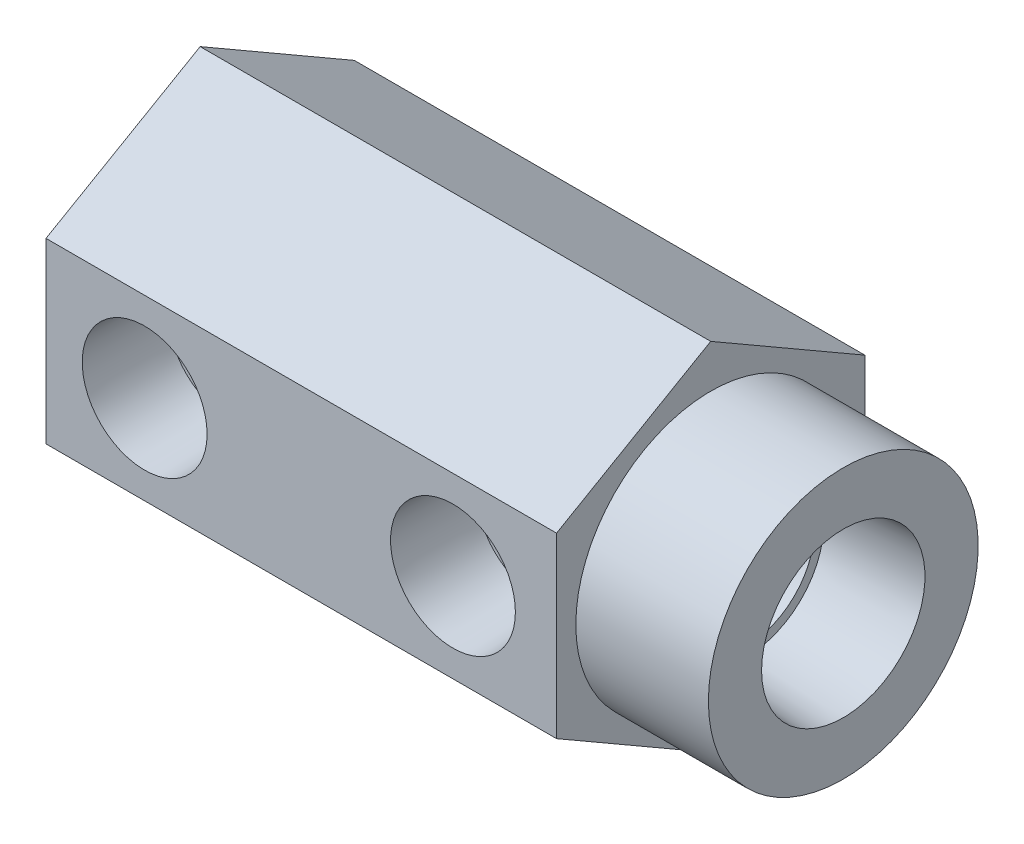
from build123d import *

# Parameters (mm, degrees)
BOSS_EXTRUDE1_DEPTH                 = 42.0624
SKETCH2_R                           = 11.1125
BOSS_EXTRUDE2_DEPTH                 = 52.9844
F_1_4_0_25_DIAMETER_HOLE1_D         = 6.35
F_1_4_0_25_DIAMETER_HOLE1_DEPTH     = 31.75
F_1_4_0_25_DIAMETER_HOLE1_TIP       = 1.907732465
F_7_32_0_21875_DIAMETER_HOLE1_D     = 5.55625
F_7_32_0_21875_DIAMETER_HOLE1_DEPTH = 44.45
F_7_32_0_21875_DIAMETER_HOLE1_TIP   = 1.669265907
F_1_8_NPT_TAPPED_HOLE1_AT_2_COUNT   = 2
F_1_8_NPT_TAPPED_HOLE1_AT_2_PITCH   = 25.4


with BuildPart() as part:
    # Sketch1 → Boss-Extrude1 (new body)
    with BuildSketch(Plane(origin=(0, 0, 0), x_dir=(0, 0, -1), z_dir=(1, 0, 0))):
        Polygon((0, -14.664696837), (12.7, -7.332348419), (12.7, 7.332348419), (0, 14.664696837), (-12.7, 7.332348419), (-12.7, -7.332348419), align=None)
    extrude(amount=BOSS_EXTRUDE1_DEPTH)

    # Sketch2 → Boss-Extrude2 (add)
    with BuildSketch(Plane(origin=(0, 0, 0), x_dir=(0, 0, -1), z_dir=(1, 0, 0))):
        with Locations(Location((0, 0, 0), (0, 0, 180))):
            Circle(SKETCH2_R)
    extrude(amount=BOSS_EXTRUDE2_DEPTH)

    # 1_4 _0.25_ Diameter Hole1
    with Locations(Plane(origin=(52.9844, 0, 0), x_dir=(0, 0, -1), z_dir=(1, 0, 0))):
        with Locations((0, 0)):
            Hole(F_1_4_0_25_DIAMETER_HOLE1_D / 2, depth=F_1_4_0_25_DIAMETER_HOLE1_DEPTH)
            with Locations((0, 0, -(F_1_4_0_25_DIAMETER_HOLE1_DEPTH + F_1_4_0_25_DIAMETER_HOLE1_TIP / 2))):  # 118° drill point
                Cone(0, F_1_4_0_25_DIAMETER_HOLE1_D / 2, F_1_4_0_25_DIAMETER_HOLE1_TIP, mode=Mode.SUBTRACT)

    # 7_32 _0.21875_ Diameter Hole1
    with Locations(Plane(origin=(52.9844, 0, 0), x_dir=(0, 0, -1), z_dir=(1, 0, 0))):
        with Locations((0, 0)):
            Hole(F_7_32_0_21875_DIAMETER_HOLE1_D / 2, depth=F_7_32_0_21875_DIAMETER_HOLE1_DEPTH)
            with Locations((0, 0, -(F_7_32_0_21875_DIAMETER_HOLE1_DEPTH + F_7_32_0_21875_DIAMETER_HOLE1_TIP / 2))):  # 118° drill point
                Cone(0, F_7_32_0_21875_DIAMETER_HOLE1_D / 2, F_7_32_0_21875_DIAMETER_HOLE1_TIP, mode=Mode.SUBTRACT)

    # Sketch7 → 1_8 NPT Tapped Hole1 (revolve, cut)
    with BuildSketch(Plane(origin=(8.128, 0, 12.7), x_dir=(0, -1, 0), z_dir=(1, 0, 0))):
        Polygon((0, 0), (0, 21.583468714), (4.2164, 19.05), (4.2164, 6.92404), (4.93618497, 6.92404), (5.1435, 0), align=None)
    f_1_8_npt_tapped_hole1 = revolve(axis=Axis((8.128, 0, 19.05), (0, 0, -1)), mode=Mode.SUBTRACT)

    # 1_8 NPT Tapped Hole1 at 2: 1_8 NPT Tapped Hole1 ×2
    with Locations(*[(i * F_1_8_NPT_TAPPED_HOLE1_AT_2_PITCH, 0, 0) for i in range(1, F_1_8_NPT_TAPPED_HOLE1_AT_2_COUNT)]):
        add(f_1_8_npt_tapped_hole1, mode=Mode.SUBTRACT)

    # Sketch9 → 1_8 NPT Tapped Hole2 (revolve, cut)
    with BuildSketch(Plane(origin=(8.128, 0, -12.7), x_dir=(0, 1, 0), z_dir=(1, 0, 0))):
        Polygon((0, 0), (0, 18.408468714), (4.2164, 15.875), (4.2164, 6.92404), (4.93618497, 6.92404), (5.1435, 0), align=None)
    revolve(axis=Axis((8.128, 0, -19.05), (0, 0, 1)), mode=Mode.SUBTRACT)

    # Sketch11 → Cut-Revolve1 (revolve, cut)
    with BuildSketch(Plane(origin=(0, 0, 0), x_dir=(1, 0, 0), z_dir=(0, 1, 0)), mode=Mode.PRIVATE) as cut_revolve1_sk:
        Polygon((52.9844, 0), (52.9844, 6.731), (45.0596, 6.315678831), (45.0596, 5.5499), (27.5844, 5.5499), (27.5844, 0), align=None)
    revolve(cut_revolve1_sk.sketch.rotate(Axis((0, 0, 0), (1, 0, 0)), 180), axis=Axis((0, 0, 0), (1, 0, 0)), mode=Mode.SUBTRACT)


solid = part.part
